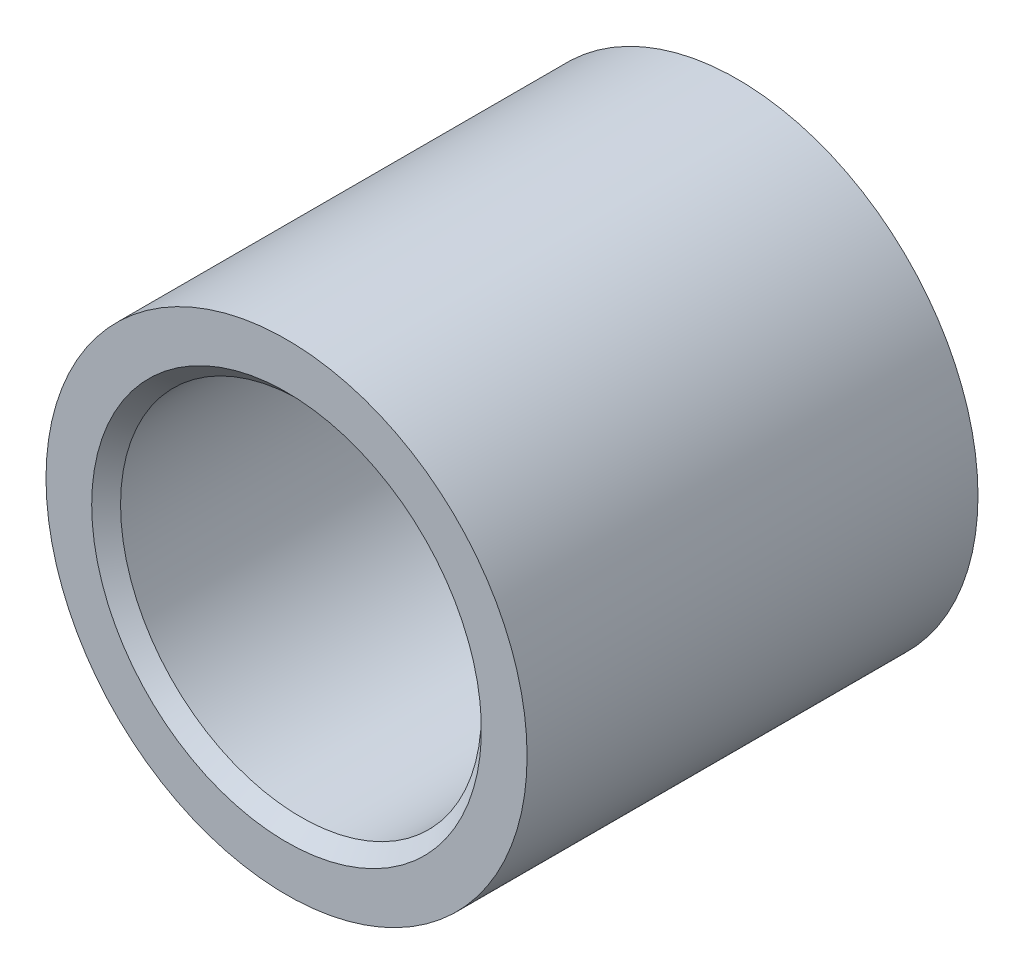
ISO-10303-21;
HEADER;
FILE_DESCRIPTION(('STEP AP214'),'2;1');
FILE_NAME('part.step','',(''),(''),'','','');
FILE_SCHEMA(('AUTOMOTIVE_DESIGN { 1 0 10303 214 1 1 1 1 }'));
ENDSEC;
DATA;
#1=APPLICATION_CONTEXT('core data for automotive mechanical design processes');
#2=APPLICATION_PROTOCOL_DEFINITION('international standard','automotive_design',2000,#1);
#3=PRODUCT_CONTEXT('',#1,'mechanical');
#4=PRODUCT('Part','Part','',(#3));
#5=PRODUCT_RELATED_PRODUCT_CATEGORY('part','',(#4));
#6=PRODUCT_DEFINITION_FORMATION('','',#4);
#7=PRODUCT_DEFINITION_CONTEXT('part definition',#1,'design');
#8=PRODUCT_DEFINITION('design','',#6,#7);
#9=PRODUCT_DEFINITION_SHAPE('','',#8);
#10=(LENGTH_UNIT() NAMED_UNIT(*) SI_UNIT(.MILLI.,.METRE.));
#11=(NAMED_UNIT(*) PLANE_ANGLE_UNIT() SI_UNIT($,.RADIAN.));
#12=(NAMED_UNIT(*) SI_UNIT($,.STERADIAN.) SOLID_ANGLE_UNIT());
#13=UNCERTAINTY_MEASURE_WITH_UNIT(LENGTH_MEASURE(1.E-05),#10,'distance_accuracy_value','');
#14=(GEOMETRIC_REPRESENTATION_CONTEXT(3) GLOBAL_UNCERTAINTY_ASSIGNED_CONTEXT((#13)) GLOBAL_UNIT_ASSIGNED_CONTEXT((#10,
#11,#12)) REPRESENTATION_CONTEXT('',''));
#15=CARTESIAN_POINT('',(0.,0.,0.));
#16=DIRECTION('',(0.,0.,1.));
#17=DIRECTION('',(1.,0.,0.));
#18=AXIS2_PLACEMENT_3D('',#15,#16,#17);
#19=CARTESIAN_POINT('',(0.,0.,31.775));
#20=DIRECTION('',(0.,0.,1.));
#21=DIRECTION('',(1.,0.,0.));
#22=AXIS2_PLACEMENT_3D('',#19,#20,#21);
#23=CYLINDRICAL_SURFACE('',#22,25.40635);
#24=CARTESIAN_POINT('',(0.,0.,0.));
#25=DIRECTION('',(0.,0.,1.));
#26=DIRECTION('',(1.,0.,0.));
#27=AXIS2_PLACEMENT_3D('',#24,#25,#26);
#28=CIRCLE('',#27,25.40635);
#29=CARTESIAN_POINT('',(25.40635,0.,0.));
#30=VERTEX_POINT('',#29);
#31=EDGE_CURVE('E32',#30,#30,#28,.T.);
#32=ORIENTED_EDGE('',*,*,#31,.F.);
#33=EDGE_LOOP('',(#32));
#34=FACE_BOUND('',#33,.T.);
#35=CARTESIAN_POINT('',(0.,0.,-47.625));
#36=DIRECTION('',(0.,0.,1.));
#37=DIRECTION('',(1.,0.,0.));
#38=AXIS2_PLACEMENT_3D('',#35,#36,#37);
#39=CIRCLE('',#38,25.40635);
#40=CARTESIAN_POINT('',(25.40635,0.,-47.625));
#41=VERTEX_POINT('',#40);
#42=EDGE_CURVE('E35',#41,#41,#39,.T.);
#43=ORIENTED_EDGE('',*,*,#42,.T.);
#44=EDGE_LOOP('',(#43));
#45=FACE_BOUND('',#44,.T.);
#46=ADVANCED_FACE('F13',(#34,#45),#23,.T.);
#47=CARTESIAN_POINT('',(25.40635,0.,0.));
#48=DIRECTION('',(0.,0.,-1.));
#49=DIRECTION('',(-1.,0.,0.));
#50=AXIS2_PLACEMENT_3D('',#47,#48,#49);
#51=PLANE('',#50);
#52=CARTESIAN_POINT('',(0.,0.,0.));
#53=DIRECTION('',(0.,0.,-1.));
#54=DIRECTION('',(-1.,0.,0.));
#55=AXIS2_PLACEMENT_3D('',#52,#53,#54);
#56=CIRCLE('',#55,20.58035);
#57=CARTESIAN_POINT('',(-20.58035,0.,0.));
#58=VERTEX_POINT('',#57);
#59=EDGE_CURVE('E9',#58,#58,#56,.T.);
#60=ORIENTED_EDGE('',*,*,#59,.T.);
#61=EDGE_LOOP('',(#60));
#62=FACE_BOUND('',#61,.T.);
#63=ORIENTED_EDGE('',*,*,#31,.T.);
#64=EDGE_LOOP('',(#63));
#65=FACE_BOUND('',#64,.T.);
#66=ADVANCED_FACE('F55',(#62,#65),#51,.F.);
#67=CARTESIAN_POINT('',(0.,0.,31.775));
#68=DIRECTION('',(0.,0.,1.));
#69=DIRECTION('',(1.,0.,0.));
#70=AXIS2_PLACEMENT_3D('',#67,#68,#69);
#71=CYLINDRICAL_SURFACE('',#70,19.05635);
#72=CARTESIAN_POINT('',(0.,0.,-46.101));
#73=DIRECTION('',(0.,0.,1.));
#74=DIRECTION('',(1.,0.,0.));
#75=AXIS2_PLACEMENT_3D('',#72,#73,#74);
#76=CIRCLE('',#75,19.05635);
#77=CARTESIAN_POINT('',(19.05635,0.,-46.101));
#78=VERTEX_POINT('',#77);
#79=EDGE_CURVE('E19',#78,#78,#76,.F.);
#80=ORIENTED_EDGE('',*,*,#79,.T.);
#81=EDGE_LOOP('',(#80));
#82=FACE_BOUND('',#81,.T.);
#83=CARTESIAN_POINT('',(0.,0.,-1.524));
#84=DIRECTION('',(0.,0.,-1.));
#85=DIRECTION('',(-1.,0.,0.));
#86=AXIS2_PLACEMENT_3D('',#83,#84,#85);
#87=CIRCLE('',#86,19.05635);
#88=CARTESIAN_POINT('',(-19.05635,0.,-1.524));
#89=VERTEX_POINT('',#88);
#90=EDGE_CURVE('E23',#89,#89,#87,.F.);
#91=ORIENTED_EDGE('',*,*,#90,.T.);
#92=EDGE_LOOP('',(#91));
#93=FACE_BOUND('',#92,.T.);
#94=ADVANCED_FACE('F43',(#82,#93),#71,.F.);
#95=CARTESIAN_POINT('',(19.05635,0.,-47.625));
#96=DIRECTION('',(0.,0.,1.));
#97=DIRECTION('',(1.,0.,0.));
#98=AXIS2_PLACEMENT_3D('',#95,#96,#97);
#99=PLANE('',#98);
#100=CARTESIAN_POINT('',(0.,0.,-47.625));
#101=DIRECTION('',(0.,0.,1.));
#102=DIRECTION('',(1.,0.,0.));
#103=AXIS2_PLACEMENT_3D('',#100,#101,#102);
#104=CIRCLE('',#103,20.58035);
#105=CARTESIAN_POINT('',(20.58035,0.,-47.625));
#106=VERTEX_POINT('',#105);
#107=EDGE_CURVE('E27',#106,#106,#104,.T.);
#108=ORIENTED_EDGE('',*,*,#107,.T.);
#109=EDGE_LOOP('',(#108));
#110=FACE_BOUND('',#109,.T.);
#111=ORIENTED_EDGE('',*,*,#42,.F.);
#112=EDGE_LOOP('',(#111));
#113=FACE_BOUND('',#112,.T.);
#114=ADVANCED_FACE('F40',(#110,#113),#99,.F.);
#115=CARTESIAN_POINT('',(0.,0.,-47.625));
#116=DIRECTION('',(0.,0.,-1.));
#117=DIRECTION('',(-1.,0.,0.));
#118=AXIS2_PLACEMENT_3D('',#115,#116,#117);
#119=CONICAL_SURFACE('',#118,20.58035,0.785398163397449);
#120=ORIENTED_EDGE('',*,*,#79,.F.);
#121=EDGE_LOOP('',(#120));
#122=FACE_BOUND('',#121,.T.);
#123=ORIENTED_EDGE('',*,*,#107,.F.);
#124=EDGE_LOOP('',(#123));
#125=FACE_BOUND('',#124,.T.);
#126=ADVANCED_FACE('F42',(#122,#125),#119,.F.);
#127=CARTESIAN_POINT('',(0.,0.,-1.524));
#128=DIRECTION('',(0.,0.,1.));
#129=DIRECTION('',(1.,0.,0.));
#130=AXIS2_PLACEMENT_3D('',#127,#128,#129);
#131=CONICAL_SURFACE('',#130,19.05635,0.785398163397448);
#132=ORIENTED_EDGE('',*,*,#59,.F.);
#133=EDGE_LOOP('',(#132));
#134=FACE_BOUND('',#133,.T.);
#135=ORIENTED_EDGE('',*,*,#90,.F.);
#136=EDGE_LOOP('',(#135));
#137=FACE_BOUND('',#136,.T.);
#138=ADVANCED_FACE('F52',(#134,#137),#131,.F.);
#139=CLOSED_SHELL('',(#46,#66,#94,#114,#126,#138));
#140=MANIFOLD_SOLID_BREP('B1',#139);
#141=ADVANCED_BREP_SHAPE_REPRESENTATION('',(#18,#140),#14);
#142=SHAPE_DEFINITION_REPRESENTATION(#9,#141);
ENDSEC;
END-ISO-10303-21;
